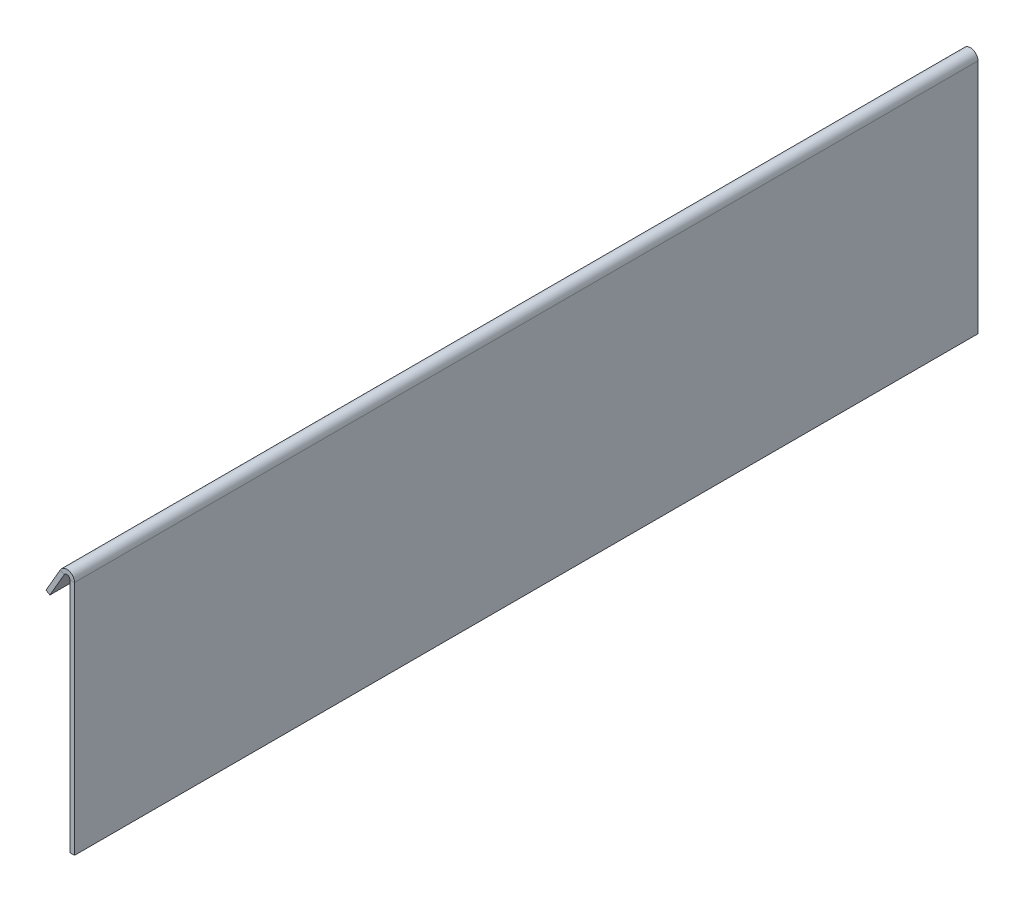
ISO-10303-21;
HEADER;
FILE_DESCRIPTION(('STEP AP214'),'2;1');
FILE_NAME('part.step','',(''),(''),'','','');
FILE_SCHEMA(('AUTOMOTIVE_DESIGN { 1 0 10303 214 1 1 1 1 }'));
ENDSEC;
DATA;
#1=APPLICATION_CONTEXT('core data for automotive mechanical design processes');
#2=APPLICATION_PROTOCOL_DEFINITION('international standard','automotive_design',2000,#1);
#3=PRODUCT_CONTEXT('',#1,'mechanical');
#4=PRODUCT('Part','Part','',(#3));
#5=PRODUCT_RELATED_PRODUCT_CATEGORY('part','',(#4));
#6=PRODUCT_DEFINITION_FORMATION('','',#4);
#7=PRODUCT_DEFINITION_CONTEXT('part definition',#1,'design');
#8=PRODUCT_DEFINITION('design','',#6,#7);
#9=PRODUCT_DEFINITION_SHAPE('','',#8);
#10=(LENGTH_UNIT() NAMED_UNIT(*) SI_UNIT(.MILLI.,.METRE.));
#11=(NAMED_UNIT(*) PLANE_ANGLE_UNIT() SI_UNIT($,.RADIAN.));
#12=(NAMED_UNIT(*) SI_UNIT($,.STERADIAN.) SOLID_ANGLE_UNIT());
#13=UNCERTAINTY_MEASURE_WITH_UNIT(LENGTH_MEASURE(1.E-05),#10,'distance_accuracy_value','');
#14=(GEOMETRIC_REPRESENTATION_CONTEXT(3) GLOBAL_UNCERTAINTY_ASSIGNED_CONTEXT((#13)) GLOBAL_UNIT_ASSIGNED_CONTEXT((#10,
#11,#12)) REPRESENTATION_CONTEXT('',''));
#15=CARTESIAN_POINT('',(0.,0.,0.));
#16=DIRECTION('',(0.,0.,1.));
#17=DIRECTION('',(1.,0.,0.));
#18=AXIS2_PLACEMENT_3D('',#15,#16,#17);
#19=CARTESIAN_POINT('',(0.,52.31,100.));
#20=DIRECTION('',(0.,0.,1.));
#21=DIRECTION('',(1.,0.,0.));
#22=AXIS2_PLACEMENT_3D('',#19,#20,#21);
#23=PLANE('',#22);
#24=DIRECTION('',(-1.,0.,0.));
#25=VECTOR('',#24,1.);
#26=CARTESIAN_POINT('',(0.,52.31,100.));
#27=LINE('',#26,#25);
#28=CARTESIAN_POINT('',(0.,52.31,100.));
#29=VERTEX_POINT('',#28);
#30=CARTESIAN_POINT('',(-0.999999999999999,52.31,100.));
#31=VERTEX_POINT('',#30);
#32=EDGE_CURVE('E11',#29,#31,#27,.T.);
#33=ORIENTED_EDGE('',*,*,#32,.F.);
#34=CARTESIAN_POINT('',(-1.69,52.31,100.));
#35=DIRECTION('',(0.,0.,1.));
#36=DIRECTION('',(1.,0.,0.));
#37=AXIS2_PLACEMENT_3D('',#34,#35,#36);
#38=CIRCLE('',#37,1.69);
#39=CARTESIAN_POINT('',(-3.15358293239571,53.155,100.));
#40=VERTEX_POINT('',#39);
#41=EDGE_CURVE('E154',#29,#40,#38,.T.);
#42=ORIENTED_EDGE('',*,*,#41,.T.);
#43=DIRECTION('',(-0.866025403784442,0.499999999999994,0.));
#44=VECTOR('',#43,1.);
#45=CARTESIAN_POINT('',(-2.28755752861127,52.655,100.));
#46=LINE('',#45,#44);
#47=CARTESIAN_POINT('',(-2.28755752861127,52.655,100.));
#48=VERTEX_POINT('',#47);
#49=EDGE_CURVE('E40',#48,#40,#46,.T.);
#50=ORIENTED_EDGE('',*,*,#49,.F.);
#51=CARTESIAN_POINT('',(-1.69,52.31,100.));
#52=DIRECTION('',(0.,0.,1.));
#53=DIRECTION('',(1.,0.,0.));
#54=AXIS2_PLACEMENT_3D('',#51,#52,#53);
#55=CIRCLE('',#54,0.690000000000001);
#56=EDGE_CURVE('E143',#31,#48,#55,.T.);
#57=ORIENTED_EDGE('',*,*,#56,.F.);
#58=EDGE_LOOP('',(#33,#42,#50,#57));
#59=FACE_BOUND('',#58,.T.);
#60=ADVANCED_FACE('F33',(#59),#23,.T.);
#61=CARTESIAN_POINT('',(-2.28755752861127,52.655,100.));
#62=DIRECTION('',(0.,0.,1.));
#63=DIRECTION('',(1.,0.,0.));
#64=AXIS2_PLACEMENT_3D('',#61,#62,#63);
#65=PLANE('',#64);
#66=DIRECTION('',(0.,1.,0.));
#67=VECTOR('',#66,1.);
#68=CARTESIAN_POINT('',(0.,0.,100.));
#69=LINE('',#68,#67);
#70=CARTESIAN_POINT('',(0.,0.,100.));
#71=VERTEX_POINT('',#70);
#72=EDGE_CURVE('E152',#71,#29,#69,.T.);
#73=ORIENTED_EDGE('',*,*,#72,.T.);
#74=ORIENTED_EDGE('',*,*,#32,.T.);
#75=DIRECTION('',(0.,1.,0.));
#76=VECTOR('',#75,1.);
#77=CARTESIAN_POINT('',(-1.,0.,100.));
#78=LINE('',#77,#76);
#79=CARTESIAN_POINT('',(-1.,0.,100.));
#80=VERTEX_POINT('',#79);
#81=EDGE_CURVE('E146',#80,#31,#78,.T.);
#82=ORIENTED_EDGE('',*,*,#81,.F.);
#83=DIRECTION('',(-1.,0.,0.));
#84=VECTOR('',#83,1.);
#85=CARTESIAN_POINT('',(0.,0.,100.));
#86=LINE('',#85,#84);
#87=EDGE_CURVE('E149',#71,#80,#86,.T.);
#88=ORIENTED_EDGE('',*,*,#87,.F.);
#89=EDGE_LOOP('',(#73,#74,#82,#88));
#90=FACE_BOUND('',#89,.T.);
#91=ADVANCED_FACE('F204',(#90),#65,.T.);
#92=CARTESIAN_POINT('',(-3.15358293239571,53.155,-100.));
#93=DIRECTION('',(0.,0.,-1.));
#94=DIRECTION('',(-1.,0.,0.));
#95=AXIS2_PLACEMENT_3D('',#92,#93,#94);
#96=PLANE('',#95);
#97=DIRECTION('',(0.866025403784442,-0.499999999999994,0.));
#98=VECTOR('',#97,1.);
#99=CARTESIAN_POINT('',(-3.15358293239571,53.155,-100.));
#100=LINE('',#99,#98);
#101=CARTESIAN_POINT('',(-3.15358293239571,53.155,-100.));
#102=VERTEX_POINT('',#101);
#103=CARTESIAN_POINT('',(-2.28755752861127,52.655,-100.));
#104=VERTEX_POINT('',#103);
#105=EDGE_CURVE('E172',#102,#104,#100,.T.);
#106=ORIENTED_EDGE('',*,*,#105,.F.);
#107=CARTESIAN_POINT('',(-1.69,52.31,-100.));
#108=DIRECTION('',(0.,0.,1.));
#109=DIRECTION('',(1.,0.,0.));
#110=AXIS2_PLACEMENT_3D('',#107,#108,#109);
#111=CIRCLE('',#110,1.69);
#112=CARTESIAN_POINT('',(0.,52.31,-100.));
#113=VERTEX_POINT('',#112);
#114=EDGE_CURVE('E134',#113,#102,#111,.T.);
#115=ORIENTED_EDGE('',*,*,#114,.F.);
#116=DIRECTION('',(1.,0.,0.));
#117=VECTOR('',#116,1.);
#118=CARTESIAN_POINT('',(-0.999999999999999,52.31,-100.));
#119=LINE('',#118,#117);
#120=CARTESIAN_POINT('',(-0.999999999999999,52.31,-100.));
#121=VERTEX_POINT('',#120);
#122=EDGE_CURVE('E105',#121,#113,#119,.T.);
#123=ORIENTED_EDGE('',*,*,#122,.F.);
#124=CARTESIAN_POINT('',(-1.69,52.31,-100.));
#125=DIRECTION('',(0.,0.,1.));
#126=DIRECTION('',(1.,0.,0.));
#127=AXIS2_PLACEMENT_3D('',#124,#125,#126);
#128=CIRCLE('',#127,0.690000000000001);
#129=EDGE_CURVE('E120',#121,#104,#128,.T.);
#130=ORIENTED_EDGE('',*,*,#129,.T.);
#131=EDGE_LOOP('',(#106,#115,#123,#130));
#132=FACE_BOUND('',#131,.T.);
#133=ADVANCED_FACE('F182',(#132),#96,.T.);
#134=CARTESIAN_POINT('',(-0.999999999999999,52.31,-100.));
#135=DIRECTION('',(0.,0.,-1.));
#136=DIRECTION('',(-1.,0.,0.));
#137=AXIS2_PLACEMENT_3D('',#134,#135,#136);
#138=PLANE('',#137);
#139=DIRECTION('',(-0.499999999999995,-0.866025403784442,0.));
#140=VECTOR('',#139,1.);
#141=CARTESIAN_POINT('',(-3.15358293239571,53.155,-100.));
#142=LINE('',#141,#140);
#143=CARTESIAN_POINT('',(-6.30858293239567,47.6903797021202,-100.));
#144=VERTEX_POINT('',#143);
#145=EDGE_CURVE('E110',#102,#144,#142,.T.);
#146=ORIENTED_EDGE('',*,*,#145,.F.);
#147=ORIENTED_EDGE('',*,*,#105,.T.);
#148=DIRECTION('',(-0.499999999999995,-0.866025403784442,0.));
#149=VECTOR('',#148,1.);
#150=CARTESIAN_POINT('',(-2.28755752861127,52.655,-100.));
#151=LINE('',#150,#149);
#152=CARTESIAN_POINT('',(-5.44255752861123,47.1903797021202,-100.));
#153=VERTEX_POINT('',#152);
#154=EDGE_CURVE('E118',#104,#153,#151,.T.);
#155=ORIENTED_EDGE('',*,*,#154,.T.);
#156=DIRECTION('',(-0.866025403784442,0.499999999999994,0.));
#157=VECTOR('',#156,1.);
#158=CARTESIAN_POINT('',(-5.44255752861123,47.1903797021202,-100.));
#159=LINE('',#158,#157);
#160=EDGE_CURVE('E99',#153,#144,#159,.T.);
#161=ORIENTED_EDGE('',*,*,#160,.T.);
#162=EDGE_LOOP('',(#146,#147,#155,#161));
#163=FACE_BOUND('',#162,.T.);
#164=ADVANCED_FACE('F116',(#163),#138,.T.);
#165=CARTESIAN_POINT('',(-3.15358293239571,53.155,100.));
#166=DIRECTION('',(0.866025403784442,-0.499999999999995,0.));
#167=DIRECTION('',(0.499999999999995,0.866025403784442,0.));
#168=AXIS2_PLACEMENT_3D('',#165,#166,#167);
#169=PLANE('',#168);
#170=ORIENTED_EDGE('',*,*,#145,.T.);
#171=DIRECTION('',(0.,0.,-1.));
#172=VECTOR('',#171,1.);
#173=CARTESIAN_POINT('',(-6.30858293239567,47.6903797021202,100.));
#174=LINE('',#173,#172);
#175=CARTESIAN_POINT('',(-6.30858293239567,47.6903797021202,100.));
#176=VERTEX_POINT('',#175);
#177=EDGE_CURVE('E95',#176,#144,#174,.T.);
#178=ORIENTED_EDGE('',*,*,#177,.F.);
#179=DIRECTION('',(-0.499999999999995,-0.866025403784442,0.));
#180=VECTOR('',#179,1.);
#181=CARTESIAN_POINT('',(-3.15358293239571,53.155,100.));
#182=LINE('',#181,#180);
#183=EDGE_CURVE('E137',#40,#176,#182,.T.);
#184=ORIENTED_EDGE('',*,*,#183,.F.);
#185=DIRECTION('',(0.,0.,-1.));
#186=VECTOR('',#185,1.);
#187=CARTESIAN_POINT('',(-3.15358293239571,53.155,100.));
#188=LINE('',#187,#186);
#189=EDGE_CURVE('E113',#40,#102,#188,.T.);
#190=ORIENTED_EDGE('',*,*,#189,.T.);
#191=EDGE_LOOP('',(#170,#178,#184,#190));
#192=FACE_BOUND('',#191,.T.);
#193=ADVANCED_FACE('F111',(#192),#169,.F.);
#194=CARTESIAN_POINT('',(-5.44255752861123,47.1903797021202,100.));
#195=DIRECTION('',(-0.499999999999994,-0.866025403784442,0.));
#196=DIRECTION('',(0.866025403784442,-0.499999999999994,0.));
#197=AXIS2_PLACEMENT_3D('',#194,#195,#196);
#198=PLANE('',#197);
#199=ORIENTED_EDGE('',*,*,#160,.F.);
#200=DIRECTION('',(0.,0.,-1.));
#201=VECTOR('',#200,1.);
#202=CARTESIAN_POINT('',(-5.44255752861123,47.1903797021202,100.));
#203=LINE('',#202,#201);
#204=CARTESIAN_POINT('',(-5.44255752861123,47.1903797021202,100.));
#205=VERTEX_POINT('',#204);
#206=EDGE_CURVE('E106',#205,#153,#203,.T.);
#207=ORIENTED_EDGE('',*,*,#206,.F.);
#208=DIRECTION('',(-0.866025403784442,0.499999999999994,0.));
#209=VECTOR('',#208,1.);
#210=CARTESIAN_POINT('',(-5.44255752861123,47.1903797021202,100.));
#211=LINE('',#210,#209);
#212=EDGE_CURVE('E102',#205,#176,#211,.T.);
#213=ORIENTED_EDGE('',*,*,#212,.T.);
#214=ORIENTED_EDGE('',*,*,#177,.T.);
#215=EDGE_LOOP('',(#199,#207,#213,#214));
#216=FACE_BOUND('',#215,.T.);
#217=ADVANCED_FACE('F97',(#216),#198,.T.);
#218=CARTESIAN_POINT('',(-2.28755752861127,52.655,100.));
#219=DIRECTION('',(0.866025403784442,-0.499999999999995,0.));
#220=DIRECTION('',(0.499999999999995,0.866025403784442,0.));
#221=AXIS2_PLACEMENT_3D('',#218,#219,#220);
#222=PLANE('',#221);
#223=ORIENTED_EDGE('',*,*,#154,.F.);
#224=DIRECTION('',(0.,0.,-1.));
#225=VECTOR('',#224,1.);
#226=CARTESIAN_POINT('',(-2.28755752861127,52.655,100.));
#227=LINE('',#226,#225);
#228=EDGE_CURVE('E167',#48,#104,#227,.T.);
#229=ORIENTED_EDGE('',*,*,#228,.F.);
#230=DIRECTION('',(-0.499999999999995,-0.866025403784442,0.));
#231=VECTOR('',#230,1.);
#232=CARTESIAN_POINT('',(-2.28755752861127,52.655,100.));
#233=LINE('',#232,#231);
#234=EDGE_CURVE('E140',#48,#205,#233,.T.);
#235=ORIENTED_EDGE('',*,*,#234,.T.);
#236=ORIENTED_EDGE('',*,*,#206,.T.);
#237=EDGE_LOOP('',(#223,#229,#235,#236));
#238=FACE_BOUND('',#237,.T.);
#239=ADVANCED_FACE('F181',(#238),#222,.T.);
#240=CARTESIAN_POINT('',(-1.69,52.31,100.));
#241=DIRECTION('',(0.,0.,-1.));
#242=DIRECTION('',(-1.,0.,0.));
#243=AXIS2_PLACEMENT_3D('',#240,#241,#242);
#244=CYLINDRICAL_SURFACE('',#243,0.690000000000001);
#245=ORIENTED_EDGE('',*,*,#129,.F.);
#246=DIRECTION('',(0.,0.,-1.));
#247=VECTOR('',#246,1.);
#248=CARTESIAN_POINT('',(-0.999999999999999,52.31,100.));
#249=LINE('',#248,#247);
#250=EDGE_CURVE('E164',#31,#121,#249,.T.);
#251=ORIENTED_EDGE('',*,*,#250,.F.);
#252=ORIENTED_EDGE('',*,*,#56,.T.);
#253=ORIENTED_EDGE('',*,*,#228,.T.);
#254=EDGE_LOOP('',(#245,#251,#252,#253));
#255=FACE_BOUND('',#254,.T.);
#256=ADVANCED_FACE('F178',(#255),#244,.F.);
#257=CARTESIAN_POINT('',(-1.,0.,100.));
#258=DIRECTION('',(-1.,0.,0.));
#259=DIRECTION('',(0.,0.,1.));
#260=AXIS2_PLACEMENT_3D('',#257,#258,#259);
#261=PLANE('',#260);
#262=DIRECTION('',(0.,1.,0.));
#263=VECTOR('',#262,1.);
#264=CARTESIAN_POINT('',(-1.,0.,-100.));
#265=LINE('',#264,#263);
#266=CARTESIAN_POINT('',(-1.,0.,-100.));
#267=VERTEX_POINT('',#266);
#268=EDGE_CURVE('E125',#267,#121,#265,.T.);
#269=ORIENTED_EDGE('',*,*,#268,.F.);
#270=DIRECTION('',(0.,0.,-1.));
#271=VECTOR('',#270,1.);
#272=CARTESIAN_POINT('',(-1.,0.,100.));
#273=LINE('',#272,#271);
#274=EDGE_CURVE('E162',#80,#267,#273,.T.);
#275=ORIENTED_EDGE('',*,*,#274,.F.);
#276=ORIENTED_EDGE('',*,*,#81,.T.);
#277=ORIENTED_EDGE('',*,*,#250,.T.);
#278=EDGE_LOOP('',(#269,#275,#276,#277));
#279=FACE_BOUND('',#278,.T.);
#280=ADVANCED_FACE('F187',(#279),#261,.T.);
#281=CARTESIAN_POINT('',(0.,0.,100.));
#282=DIRECTION('',(0.,-1.,0.));
#283=DIRECTION('',(0.,0.,-1.));
#284=AXIS2_PLACEMENT_3D('',#281,#282,#283);
#285=PLANE('',#284);
#286=DIRECTION('',(-1.,0.,0.));
#287=VECTOR('',#286,1.);
#288=CARTESIAN_POINT('',(0.,0.,-100.));
#289=LINE('',#288,#287);
#290=CARTESIAN_POINT('',(0.,0.,-100.));
#291=VERTEX_POINT('',#290);
#292=EDGE_CURVE('E128',#291,#267,#289,.T.);
#293=ORIENTED_EDGE('',*,*,#292,.F.);
#294=DIRECTION('',(0.,0.,-1.));
#295=VECTOR('',#294,1.);
#296=CARTESIAN_POINT('',(0.,0.,100.));
#297=LINE('',#296,#295);
#298=EDGE_CURVE('E160',#71,#291,#297,.T.);
#299=ORIENTED_EDGE('',*,*,#298,.F.);
#300=ORIENTED_EDGE('',*,*,#87,.T.);
#301=ORIENTED_EDGE('',*,*,#274,.T.);
#302=EDGE_LOOP('',(#293,#299,#300,#301));
#303=FACE_BOUND('',#302,.T.);
#304=ADVANCED_FACE('F226',(#303),#285,.T.);
#305=CARTESIAN_POINT('',(0.,0.,100.));
#306=DIRECTION('',(-1.,0.,0.));
#307=DIRECTION('',(0.,0.,1.));
#308=AXIS2_PLACEMENT_3D('',#305,#306,#307);
#309=PLANE('',#308);
#310=DIRECTION('',(0.,1.,0.));
#311=VECTOR('',#310,1.);
#312=CARTESIAN_POINT('',(0.,0.,-100.));
#313=LINE('',#312,#311);
#314=EDGE_CURVE('E131',#291,#113,#313,.T.);
#315=ORIENTED_EDGE('',*,*,#314,.T.);
#316=DIRECTION('',(0.,0.,-1.));
#317=VECTOR('',#316,1.);
#318=CARTESIAN_POINT('',(0.,52.31,100.));
#319=LINE('',#318,#317);
#320=EDGE_CURVE('E157',#29,#113,#319,.T.);
#321=ORIENTED_EDGE('',*,*,#320,.F.);
#322=ORIENTED_EDGE('',*,*,#72,.F.);
#323=ORIENTED_EDGE('',*,*,#298,.T.);
#324=EDGE_LOOP('',(#315,#321,#322,#323));
#325=FACE_BOUND('',#324,.T.);
#326=ADVANCED_FACE('F201',(#325),#309,.F.);
#327=CARTESIAN_POINT('',(-1.69,52.31,100.));
#328=DIRECTION('',(0.,0.,-1.));
#329=DIRECTION('',(-1.,0.,0.));
#330=AXIS2_PLACEMENT_3D('',#327,#328,#329);
#331=CYLINDRICAL_SURFACE('',#330,1.69);
#332=ORIENTED_EDGE('',*,*,#114,.T.);
#333=ORIENTED_EDGE('',*,*,#189,.F.);
#334=ORIENTED_EDGE('',*,*,#41,.F.);
#335=ORIENTED_EDGE('',*,*,#320,.T.);
#336=EDGE_LOOP('',(#332,#333,#334,#335));
#337=FACE_BOUND('',#336,.T.);
#338=ADVANCED_FACE('F191',(#337),#331,.T.);
#339=CARTESIAN_POINT('',(-1.69,52.31,100.));
#340=DIRECTION('',(0.,0.,1.));
#341=DIRECTION('',(1.,0.,0.));
#342=AXIS2_PLACEMENT_3D('',#339,#340,#341);
#343=PLANE('',#342);
#344=ORIENTED_EDGE('',*,*,#183,.T.);
#345=ORIENTED_EDGE('',*,*,#212,.F.);
#346=ORIENTED_EDGE('',*,*,#234,.F.);
#347=ORIENTED_EDGE('',*,*,#49,.T.);
#348=EDGE_LOOP('',(#344,#345,#346,#347));
#349=FACE_BOUND('',#348,.T.);
#350=ADVANCED_FACE('F192',(#349),#343,.T.);
#351=CARTESIAN_POINT('',(-1.69,52.31,-100.));
#352=DIRECTION('',(0.,0.,1.));
#353=DIRECTION('',(1.,0.,0.));
#354=AXIS2_PLACEMENT_3D('',#351,#352,#353);
#355=PLANE('',#354);
#356=ORIENTED_EDGE('',*,*,#268,.T.);
#357=ORIENTED_EDGE('',*,*,#122,.T.);
#358=ORIENTED_EDGE('',*,*,#314,.F.);
#359=ORIENTED_EDGE('',*,*,#292,.T.);
#360=EDGE_LOOP('',(#356,#357,#358,#359));
#361=FACE_BOUND('',#360,.T.);
#362=ADVANCED_FACE('F194',(#361),#355,.F.);
#363=CLOSED_SHELL('',(#60,#91,#133,#164,#193,#217,#239,#256,#280,#304,#326,#338,#350,#362));
#364=MANIFOLD_SOLID_BREP('B2',#363);
#365=ADVANCED_BREP_SHAPE_REPRESENTATION('',(#18,#364),#14);
#366=SHAPE_DEFINITION_REPRESENTATION(#9,#365);
ENDSEC;
END-ISO-10303-21;
